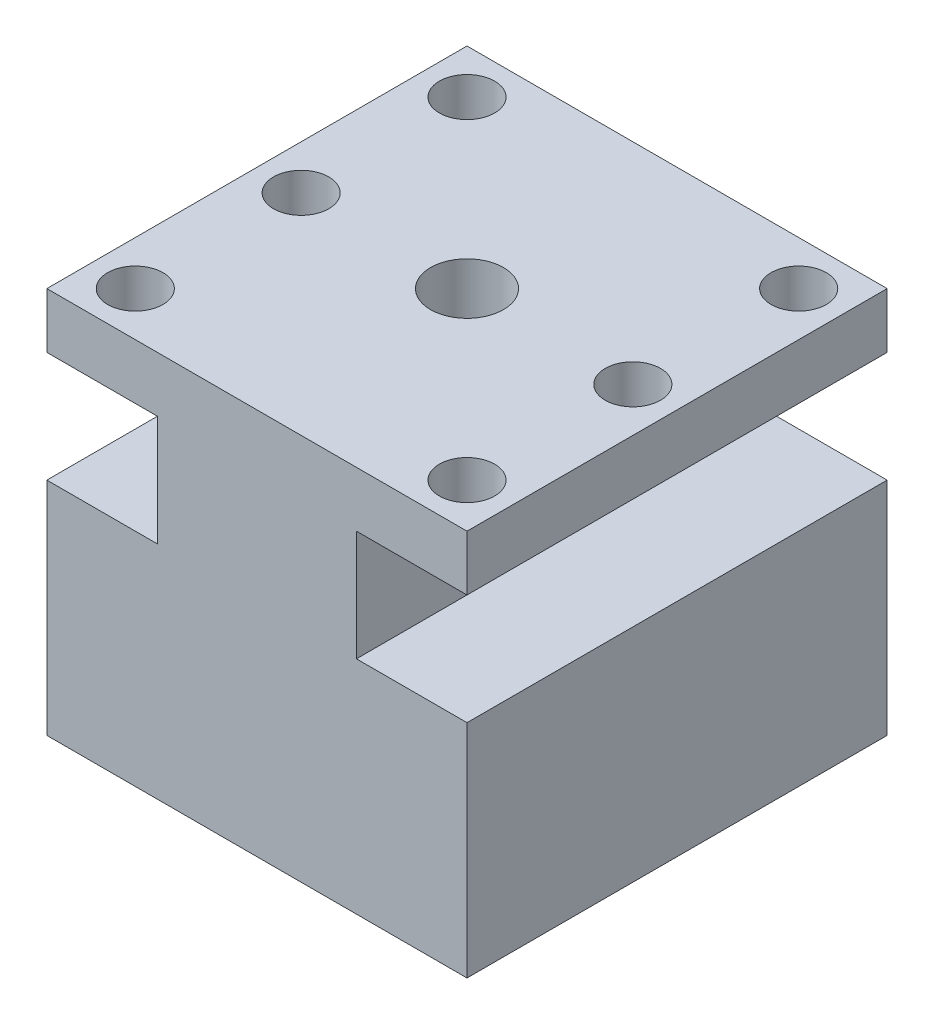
from build123d import *

# Parameters (mm, degrees)
SCHIZZO1_W                   = 38
SCHIZZO1_H                   = 38
ESTRUSIONE_ESTRUSIONE1_DEPTH = 20
SCHIZZO2_W                   = 18
SCHIZZO2_H                   = 38
ESTRUSIONE_ESTRUSIONE2_DEPTH = 10
SCHIZZO3_W                   = 38
SCHIZZO3_H                   = 38
ESTRUSIONE_ESTRUSIONE3_DEPTH = 5
SCHIZZO5_R                   = 3.25
TAGLIO_ESTRUSIONE2_DEPTH     = 15
FORO_FILETTATO_M6_1_D        = 5
FORO_FILETTATO_M6_1_DEPTH    = 5
FORO_PER_VITE_M6_1_D         = 6.6


with BuildPart() as part:
    # Schizzo1 → Estrusione-Estrusione1 (new body)
    with BuildSketch(Plane(origin=(0, 0, 0), x_dir=(1, 0, 0), z_dir=(0, 1, 0))):
        Rectangle(SCHIZZO1_W, SCHIZZO1_H)
    extrude(amount=ESTRUSIONE_ESTRUSIONE1_DEPTH)

    # Schizzo2 → Estrusione-Estrusione2 (add)
    with BuildSketch(Plane(origin=(0, 20, 0), x_dir=(1, 0, 0), z_dir=(0, 1, 0))):
        Rectangle(SCHIZZO2_W, SCHIZZO2_H)
    extrude(amount=ESTRUSIONE_ESTRUSIONE2_DEPTH)

    # Schizzo3 → Estrusione-Estrusione3 (add)
    with BuildSketch(Plane(origin=(0, 30, 0), x_dir=(1, 0, 0), z_dir=(0, 1, 0))):
        Rectangle(SCHIZZO3_W, SCHIZZO3_H)
    extrude(amount=ESTRUSIONE_ESTRUSIONE3_DEPTH)

    # Schizzo5 → Taglio-Estrusione2 (cut)
    with BuildSketch(Plane(origin=(0, 0, 0), x_dir=(-1, 0, 0), z_dir=(0, -1, 0))):
        with Locations(Location((0, 0, 0), (0, 0, 90))):
            Circle(SCHIZZO5_R)
    extrude(amount=-TAGLIO_ESTRUSIONE2_DEPTH, mode=Mode.SUBTRACT)

    # Foro filettato M6-1
    with Locations(Plane(origin=(0, 35, 0), x_dir=(1, 0, 0), z_dir=(0, 1, 0))):
        with Locations((-15, 15), (-15, 0), (-15, -15), (15, 15), (15, 0), (15, -15)):
            Hole(FORO_FILETTATO_M6_1_D / 2, depth=FORO_FILETTATO_M6_1_DEPTH)

    # Foro per Vite M6-1 (through all)
    with Locations(Plane(origin=(0, 35, 0), x_dir=(1, 0, 0), z_dir=(0, 1, 0))):
        with Locations((0, 0)):
            Hole(FORO_PER_VITE_M6_1_D / 2)


solid = part.part
